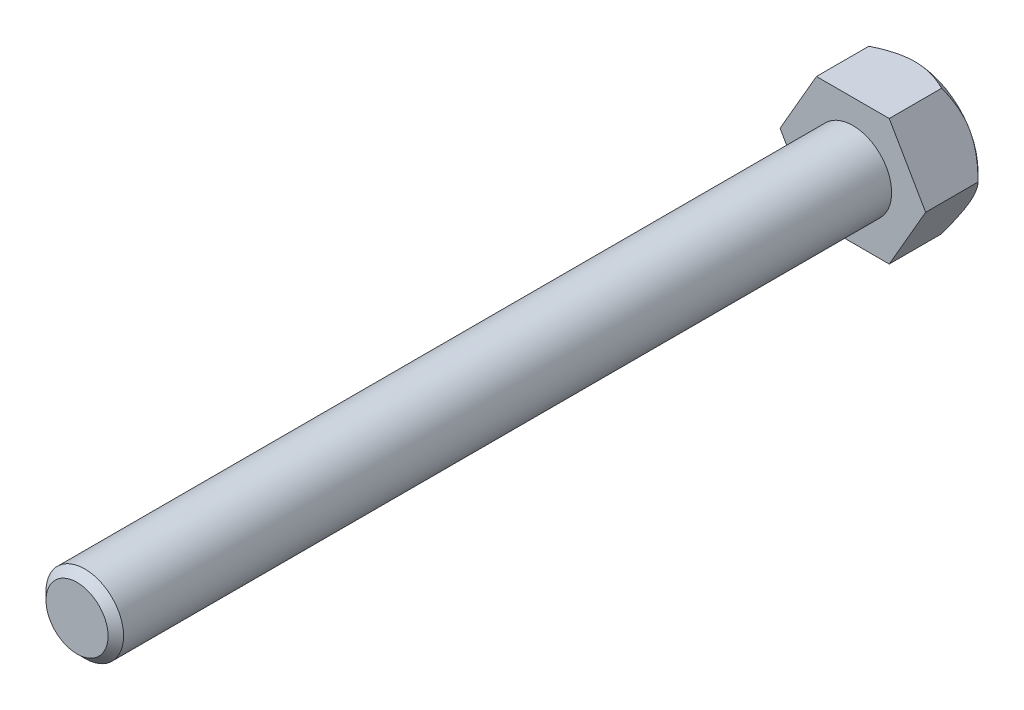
from build123d import *

# Parameters (mm, degrees)
EXTRUSION1_DEPTH = 6.4
ESQUISSE2_R      = 4
EXTRUSION2_DEPTH = 80
CHANFREIN1_SIZE  = 0.8


with BuildPart() as part:
    # Esquisse1 → Extrusion1 (new body)
    with BuildSketch(Plane.XY):
        Polygon((7.505553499, 0), (3.75277675, 6.5), (-3.75277675, 6.5), (-7.505553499, 0), (-3.75277675, -6.5), (3.75277675, -6.5), align=None)
    extrude(amount=EXTRUSION1_DEPTH)

    # Esquisse2 → Extrusion2 (add)
    with BuildSketch(Plane.XY.offset(6.4)):
        with Locations(Location((0, 0, 0), (0, 0, 180))):
            Circle(ESQUISSE2_R)
    extrude(amount=EXTRUSION2_DEPTH)

    # Esquisse3 → Enl_vement de mati_re-R_volution1 (revolve, cut)
    with BuildSketch(Plane(origin=(0, 0, 0), x_dir=(1, 0, 0), z_dir=(0, 1, 0))):
        Polygon((7.505553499, 0), (6.505553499, 0), (7.505553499, -1), align=None)
    revolve(axis=Axis((0, 0, 0), (0, 0, 1)), mode=Mode.SUBTRACT)

    # Chanfrein1
    chanfrein1_edges = [part.edges().sort_by_distance(p)[0] for p in [
        (4, 0, 86.4),
    ]]
    chamfer(chanfrein1_edges, length=CHANFREIN1_SIZE)


solid = part.part
